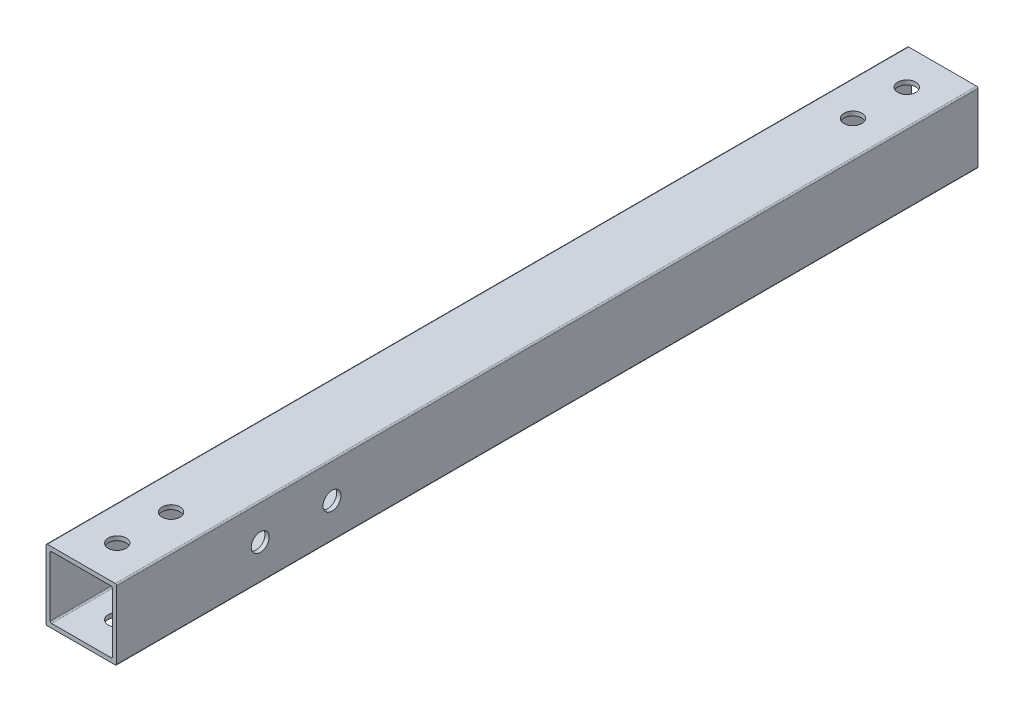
ISO-10303-21;
HEADER;
FILE_DESCRIPTION(('STEP AP214'),'2;1');
FILE_NAME('part.step','',(''),(''),'','','');
FILE_SCHEMA(('AUTOMOTIVE_DESIGN { 1 0 10303 214 1 1 1 1 }'));
ENDSEC;
DATA;
#1=APPLICATION_CONTEXT('core data for automotive mechanical design processes');
#2=APPLICATION_PROTOCOL_DEFINITION('international standard','automotive_design',2000,#1);
#3=PRODUCT_CONTEXT('',#1,'mechanical');
#4=PRODUCT('Part','Part','',(#3));
#5=PRODUCT_RELATED_PRODUCT_CATEGORY('part','',(#4));
#6=PRODUCT_DEFINITION_FORMATION('','',#4);
#7=PRODUCT_DEFINITION_CONTEXT('part definition',#1,'design');
#8=PRODUCT_DEFINITION('design','',#6,#7);
#9=PRODUCT_DEFINITION_SHAPE('','',#8);
#10=(LENGTH_UNIT() NAMED_UNIT(*) SI_UNIT(.MILLI.,.METRE.));
#11=(NAMED_UNIT(*) PLANE_ANGLE_UNIT() SI_UNIT($,.RADIAN.));
#12=(NAMED_UNIT(*) SI_UNIT($,.STERADIAN.) SOLID_ANGLE_UNIT());
#13=UNCERTAINTY_MEASURE_WITH_UNIT(LENGTH_MEASURE(1.E-05),#10,'distance_accuracy_value','');
#14=(GEOMETRIC_REPRESENTATION_CONTEXT(3) GLOBAL_UNCERTAINTY_ASSIGNED_CONTEXT((#13)) GLOBAL_UNIT_ASSIGNED_CONTEXT((#10,
#11,#12)) REPRESENTATION_CONTEXT('',''));
#15=CARTESIAN_POINT('',(0.,0.,0.));
#16=DIRECTION('',(0.,0.,1.));
#17=DIRECTION('',(1.,0.,0.));
#18=AXIS2_PLACEMENT_3D('',#15,#16,#17);
#19=CARTESIAN_POINT('',(-11.9999999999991,-11.9999999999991,-1695.2));
#20=DIRECTION('',(0.,0.,-1.));
#21=DIRECTION('',(-1.,0.,0.));
#22=AXIS2_PLACEMENT_3D('',#19,#20,#21);
#23=CYLINDRICAL_SURFACE('',#22,0.500000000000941);
#24=CARTESIAN_POINT('',(-11.9999999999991,-11.9999999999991,-2000.));
#25=DIRECTION('',(0.,0.,-1.));
#26=DIRECTION('',(-1.,0.,0.));
#27=AXIS2_PLACEMENT_3D('',#24,#25,#26);
#28=CIRCLE('',#27,0.500000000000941);
#29=CARTESIAN_POINT('',(-11.9999999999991,-12.5,-2000.));
#30=VERTEX_POINT('',#29);
#31=CARTESIAN_POINT('',(-12.5,-11.9999999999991,-2000.));
#32=VERTEX_POINT('',#31);
#33=EDGE_CURVE('E219',#30,#32,#28,.T.);
#34=ORIENTED_EDGE('',*,*,#33,.F.);
#35=DIRECTION('',(0.,0.,-1.));
#36=VECTOR('',#35,1.);
#37=CARTESIAN_POINT('',(-11.9999999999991,-12.5,-1695.2));
#38=LINE('',#37,#36);
#39=CARTESIAN_POINT('',(-11.9999999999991,-12.5,-1695.2));
#40=VERTEX_POINT('',#39);
#41=EDGE_CURVE('E11',#40,#30,#38,.T.);
#42=ORIENTED_EDGE('',*,*,#41,.F.);
#43=CARTESIAN_POINT('',(-11.9999999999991,-11.9999999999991,-1695.2));
#44=DIRECTION('',(0.,0.,-1.));
#45=DIRECTION('',(-1.,0.,0.));
#46=AXIS2_PLACEMENT_3D('',#43,#44,#45);
#47=CIRCLE('',#46,0.500000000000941);
#48=CARTESIAN_POINT('',(-12.5,-11.9999999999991,-1695.2));
#49=VERTEX_POINT('',#48);
#50=EDGE_CURVE('E231',#40,#49,#47,.T.);
#51=ORIENTED_EDGE('',*,*,#50,.T.);
#52=DIRECTION('',(0.,0.,-1.));
#53=VECTOR('',#52,1.);
#54=CARTESIAN_POINT('',(-12.5,-11.9999999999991,-1695.2));
#55=LINE('',#54,#53);
#56=EDGE_CURVE('E256',#49,#32,#55,.T.);
#57=ORIENTED_EDGE('',*,*,#56,.T.);
#58=EDGE_LOOP('',(#34,#42,#51,#57));
#59=FACE_BOUND('',#58,.T.);
#60=ADVANCED_FACE('F46',(#59),#23,.T.);
#61=CARTESIAN_POINT('',(11.9999999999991,-12.5,-1695.2));
#62=DIRECTION('',(0.,-1.,0.));
#63=DIRECTION('',(1.,0.,0.));
#64=AXIS2_PLACEMENT_3D('',#61,#62,#63);
#65=PLANE('',#64);
#66=CARTESIAN_POINT('',(0.,-12.5,-1987.3));
#67=DIRECTION('',(0.,-1.,0.));
#68=DIRECTION('',(1.,0.,0.));
#69=AXIS2_PLACEMENT_3D('',#66,#67,#68);
#70=CIRCLE('',#69,3.17500000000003);
#71=CARTESIAN_POINT('',(3.17500000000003,-12.5,-1987.3));
#72=VERTEX_POINT('',#71);
#73=EDGE_CURVE('E295',#72,#72,#70,.F.);
#74=ORIENTED_EDGE('',*,*,#73,.T.);
#75=EDGE_LOOP('',(#74));
#76=FACE_BOUND('',#75,.T.);
#77=CARTESIAN_POINT('',(0.,-12.5,-1726.95));
#78=DIRECTION('',(0.,-1.,0.));
#79=DIRECTION('',(1.,0.,0.));
#80=AXIS2_PLACEMENT_3D('',#77,#78,#79);
#81=CIRCLE('',#80,3.17500000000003);
#82=CARTESIAN_POINT('',(3.17500000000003,-12.5,-1726.95));
#83=VERTEX_POINT('',#82);
#84=EDGE_CURVE('E331',#83,#83,#81,.F.);
#85=ORIENTED_EDGE('',*,*,#84,.T.);
#86=EDGE_LOOP('',(#85));
#87=FACE_BOUND('',#86,.T.);
#88=CARTESIAN_POINT('',(0.,-12.5,-1707.9));
#89=DIRECTION('',(0.,-1.,0.));
#90=DIRECTION('',(1.,0.,0.));
#91=AXIS2_PLACEMENT_3D('',#88,#89,#90);
#92=CIRCLE('',#91,3.17500000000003);
#93=CARTESIAN_POINT('',(3.17500000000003,-12.5,-1707.9));
#94=VERTEX_POINT('',#93);
#95=EDGE_CURVE('E343',#94,#94,#92,.F.);
#96=ORIENTED_EDGE('',*,*,#95,.T.);
#97=EDGE_LOOP('',(#96));
#98=FACE_BOUND('',#97,.T.);
#99=CARTESIAN_POINT('',(0.,-12.5,-1968.25));
#100=DIRECTION('',(0.,-1.,0.));
#101=DIRECTION('',(1.,0.,0.));
#102=AXIS2_PLACEMENT_3D('',#99,#100,#101);
#103=CIRCLE('',#102,3.17500000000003);
#104=CARTESIAN_POINT('',(3.17500000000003,-12.5,-1968.25));
#105=VERTEX_POINT('',#104);
#106=EDGE_CURVE('E344',#105,#105,#103,.F.);
#107=ORIENTED_EDGE('',*,*,#106,.T.);
#108=EDGE_LOOP('',(#107));
#109=FACE_BOUND('',#108,.T.);
#110=DIRECTION('',(-1.,0.,0.));
#111=VECTOR('',#110,1.);
#112=CARTESIAN_POINT('',(11.9999999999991,-12.5,-2000.));
#113=LINE('',#112,#111);
#114=CARTESIAN_POINT('',(11.9999999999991,-12.5,-2000.));
#115=VERTEX_POINT('',#114);
#116=EDGE_CURVE('E235',#115,#30,#113,.T.);
#117=ORIENTED_EDGE('',*,*,#116,.F.);
#118=DIRECTION('',(0.,0.,-1.));
#119=VECTOR('',#118,1.);
#120=CARTESIAN_POINT('',(11.9999999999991,-12.5,-1695.2));
#121=LINE('',#120,#119);
#122=CARTESIAN_POINT('',(11.9999999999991,-12.5,-1695.2));
#123=VERTEX_POINT('',#122);
#124=EDGE_CURVE('E54',#123,#115,#121,.T.);
#125=ORIENTED_EDGE('',*,*,#124,.F.);
#126=DIRECTION('',(-1.,0.,0.));
#127=VECTOR('',#126,1.);
#128=CARTESIAN_POINT('',(11.9999999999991,-12.5,-1695.2));
#129=LINE('',#128,#127);
#130=EDGE_CURVE('E253',#123,#40,#129,.T.);
#131=ORIENTED_EDGE('',*,*,#130,.T.);
#132=ORIENTED_EDGE('',*,*,#41,.T.);
#133=EDGE_LOOP('',(#117,#125,#131,#132));
#134=FACE_BOUND('',#133,.T.);
#135=ADVANCED_FACE('F387',(#76,#87,#98,#109,#134),#65,.T.);
#136=CARTESIAN_POINT('',(11.9999999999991,-11.9999999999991,-1695.2));
#137=DIRECTION('',(0.,0.,-1.));
#138=DIRECTION('',(-1.,0.,0.));
#139=AXIS2_PLACEMENT_3D('',#136,#137,#138);
#140=CYLINDRICAL_SURFACE('',#139,0.500000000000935);
#141=CARTESIAN_POINT('',(11.9999999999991,-11.9999999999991,-2000.));
#142=DIRECTION('',(0.,0.,-1.));
#143=DIRECTION('',(-1.,0.,0.));
#144=AXIS2_PLACEMENT_3D('',#141,#142,#143);
#145=CIRCLE('',#144,0.500000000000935);
#146=CARTESIAN_POINT('',(12.5,-11.9999999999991,-2000.));
#147=VERTEX_POINT('',#146);
#148=EDGE_CURVE('E274',#147,#115,#145,.T.);
#149=ORIENTED_EDGE('',*,*,#148,.F.);
#150=DIRECTION('',(0.,0.,-1.));
#151=VECTOR('',#150,1.);
#152=CARTESIAN_POINT('',(12.5,-11.9999999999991,-1695.2));
#153=LINE('',#152,#151);
#154=CARTESIAN_POINT('',(12.5,-11.9999999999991,-1695.2));
#155=VERTEX_POINT('',#154);
#156=EDGE_CURVE('E280',#155,#147,#153,.T.);
#157=ORIENTED_EDGE('',*,*,#156,.F.);
#158=CARTESIAN_POINT('',(11.9999999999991,-11.9999999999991,-1695.2));
#159=DIRECTION('',(0.,0.,-1.));
#160=DIRECTION('',(-1.,0.,0.));
#161=AXIS2_PLACEMENT_3D('',#158,#159,#160);
#162=CIRCLE('',#161,0.500000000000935);
#163=EDGE_CURVE('E250',#155,#123,#162,.T.);
#164=ORIENTED_EDGE('',*,*,#163,.T.);
#165=ORIENTED_EDGE('',*,*,#124,.T.);
#166=EDGE_LOOP('',(#149,#157,#164,#165));
#167=FACE_BOUND('',#166,.T.);
#168=ADVANCED_FACE('F392',(#167),#140,.T.);
#169=CARTESIAN_POINT('',(12.5,11.9999999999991,-1695.2));
#170=DIRECTION('',(1.,0.,0.));
#171=DIRECTION('',(0.,1.,0.));
#172=AXIS2_PLACEMENT_3D('',#169,#170,#171);
#173=PLANE('',#172);
#174=CARTESIAN_POINT('',(12.5,0.,-1771.4));
#175=DIRECTION('',(1.,0.,0.));
#176=DIRECTION('',(0.,1.,0.));
#177=AXIS2_PLACEMENT_3D('',#174,#175,#176);
#178=CIRCLE('',#177,3.17499999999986);
#179=CARTESIAN_POINT('',(12.5,3.17499999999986,-1771.4));
#180=VERTEX_POINT('',#179);
#181=EDGE_CURVE('E315',#180,#180,#178,.T.);
#182=ORIENTED_EDGE('',*,*,#181,.F.);
#183=EDGE_LOOP('',(#182));
#184=FACE_BOUND('',#183,.T.);
#185=CARTESIAN_POINT('',(12.5,0.,-1746.));
#186=DIRECTION('',(1.,0.,0.));
#187=DIRECTION('',(0.,1.,0.));
#188=AXIS2_PLACEMENT_3D('',#185,#186,#187);
#189=CIRCLE('',#188,3.17499999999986);
#190=CARTESIAN_POINT('',(12.5,3.17499999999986,-1746.));
#191=VERTEX_POINT('',#190);
#192=EDGE_CURVE('E320',#191,#191,#189,.T.);
#193=ORIENTED_EDGE('',*,*,#192,.F.);
#194=EDGE_LOOP('',(#193));
#195=FACE_BOUND('',#194,.T.);
#196=DIRECTION('',(0.,-1.,0.));
#197=VECTOR('',#196,1.);
#198=CARTESIAN_POINT('',(12.5,11.9999999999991,-2000.));
#199=LINE('',#198,#197);
#200=CARTESIAN_POINT('',(12.5,11.9999999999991,-2000.));
#201=VERTEX_POINT('',#200);
#202=EDGE_CURVE('E271',#201,#147,#199,.T.);
#203=ORIENTED_EDGE('',*,*,#202,.F.);
#204=DIRECTION('',(0.,0.,-1.));
#205=VECTOR('',#204,1.);
#206=CARTESIAN_POINT('',(12.5,11.9999999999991,-1695.2));
#207=LINE('',#206,#205);
#208=CARTESIAN_POINT('',(12.5,11.9999999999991,-1695.2));
#209=VERTEX_POINT('',#208);
#210=EDGE_CURVE('E282',#209,#201,#207,.T.);
#211=ORIENTED_EDGE('',*,*,#210,.F.);
#212=DIRECTION('',(0.,-1.,0.));
#213=VECTOR('',#212,1.);
#214=CARTESIAN_POINT('',(12.5,11.9999999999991,-1695.2));
#215=LINE('',#214,#213);
#216=EDGE_CURVE('E247',#209,#155,#215,.T.);
#217=ORIENTED_EDGE('',*,*,#216,.T.);
#218=ORIENTED_EDGE('',*,*,#156,.T.);
#219=EDGE_LOOP('',(#203,#211,#217,#218));
#220=FACE_BOUND('',#219,.T.);
#221=ADVANCED_FACE('F423',(#184,#195,#220),#173,.T.);
#222=CARTESIAN_POINT('',(11.9999999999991,11.9999999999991,-1695.2));
#223=DIRECTION('',(0.,0.,-1.));
#224=DIRECTION('',(-1.,0.,0.));
#225=AXIS2_PLACEMENT_3D('',#222,#223,#224);
#226=CYLINDRICAL_SURFACE('',#225,0.500000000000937);
#227=CARTESIAN_POINT('',(11.9999999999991,11.9999999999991,-2000.));
#228=DIRECTION('',(0.,0.,-1.));
#229=DIRECTION('',(-1.,0.,0.));
#230=AXIS2_PLACEMENT_3D('',#227,#228,#229);
#231=CIRCLE('',#230,0.500000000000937);
#232=CARTESIAN_POINT('',(11.9999999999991,12.5,-2000.));
#233=VERTEX_POINT('',#232);
#234=EDGE_CURVE('E268',#233,#201,#231,.T.);
#235=ORIENTED_EDGE('',*,*,#234,.F.);
#236=DIRECTION('',(0.,0.,-1.));
#237=VECTOR('',#236,1.);
#238=CARTESIAN_POINT('',(11.9999999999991,12.5,-1695.2));
#239=LINE('',#238,#237);
#240=CARTESIAN_POINT('',(11.9999999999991,12.5,-1695.2));
#241=VERTEX_POINT('',#240);
#242=EDGE_CURVE('E284',#241,#233,#239,.T.);
#243=ORIENTED_EDGE('',*,*,#242,.F.);
#244=CARTESIAN_POINT('',(11.9999999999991,11.9999999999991,-1695.2));
#245=DIRECTION('',(0.,0.,-1.));
#246=DIRECTION('',(-1.,0.,0.));
#247=AXIS2_PLACEMENT_3D('',#244,#245,#246);
#248=CIRCLE('',#247,0.500000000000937);
#249=EDGE_CURVE('E244',#241,#209,#248,.T.);
#250=ORIENTED_EDGE('',*,*,#249,.T.);
#251=ORIENTED_EDGE('',*,*,#210,.T.);
#252=EDGE_LOOP('',(#235,#243,#250,#251));
#253=FACE_BOUND('',#252,.T.);
#254=ADVANCED_FACE('F420',(#253),#226,.T.);
#255=CARTESIAN_POINT('',(-11.9999999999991,12.5,-1695.2));
#256=DIRECTION('',(0.,1.,0.));
#257=DIRECTION('',(-1.,0.,0.));
#258=AXIS2_PLACEMENT_3D('',#255,#256,#257);
#259=PLANE('',#258);
#260=CARTESIAN_POINT('',(0.,12.5,-1987.3));
#261=DIRECTION('',(0.,1.,0.));
#262=DIRECTION('',(-1.,0.,0.));
#263=AXIS2_PLACEMENT_3D('',#260,#261,#262);
#264=CIRCLE('',#263,3.17500000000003);
#265=CARTESIAN_POINT('',(-3.17500000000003,12.5,-1987.3));
#266=VERTEX_POINT('',#265);
#267=EDGE_CURVE('E332',#266,#266,#264,.T.);
#268=ORIENTED_EDGE('',*,*,#267,.F.);
#269=EDGE_LOOP('',(#268));
#270=FACE_BOUND('',#269,.T.);
#271=CARTESIAN_POINT('',(0.,12.5,-1726.95));
#272=DIRECTION('',(0.,1.,0.));
#273=DIRECTION('',(1.,0.,0.));
#274=AXIS2_PLACEMENT_3D('',#271,#272,#273);
#275=CIRCLE('',#274,3.17500000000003);
#276=CARTESIAN_POINT('',(3.17500000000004,12.5,-1726.95));
#277=VERTEX_POINT('',#276);
#278=EDGE_CURVE('E340',#277,#277,#275,.T.);
#279=ORIENTED_EDGE('',*,*,#278,.F.);
#280=EDGE_LOOP('',(#279));
#281=FACE_BOUND('',#280,.T.);
#282=CARTESIAN_POINT('',(0.,12.5,-1707.9));
#283=DIRECTION('',(0.,1.,0.));
#284=DIRECTION('',(1.,0.,0.));
#285=AXIS2_PLACEMENT_3D('',#282,#283,#284);
#286=CIRCLE('',#285,3.17500000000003);
#287=CARTESIAN_POINT('',(3.17500000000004,12.5,-1707.9));
#288=VERTEX_POINT('',#287);
#289=EDGE_CURVE('E347',#288,#288,#286,.T.);
#290=ORIENTED_EDGE('',*,*,#289,.F.);
#291=EDGE_LOOP('',(#290));
#292=FACE_BOUND('',#291,.T.);
#293=CARTESIAN_POINT('',(0.,12.5,-1968.25));
#294=DIRECTION('',(0.,1.,0.));
#295=DIRECTION('',(-1.,0.,0.));
#296=AXIS2_PLACEMENT_3D('',#293,#294,#295);
#297=CIRCLE('',#296,3.17500000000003);
#298=CARTESIAN_POINT('',(-3.17500000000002,12.5,-1968.25));
#299=VERTEX_POINT('',#298);
#300=EDGE_CURVE('E335',#299,#299,#297,.T.);
#301=ORIENTED_EDGE('',*,*,#300,.F.);
#302=EDGE_LOOP('',(#301));
#303=FACE_BOUND('',#302,.T.);
#304=DIRECTION('',(1.,0.,0.));
#305=VECTOR('',#304,1.);
#306=CARTESIAN_POINT('',(-11.9999999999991,12.5,-2000.));
#307=LINE('',#306,#305);
#308=CARTESIAN_POINT('',(-11.9999999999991,12.5,-2000.));
#309=VERTEX_POINT('',#308);
#310=EDGE_CURVE('E265',#309,#233,#307,.T.);
#311=ORIENTED_EDGE('',*,*,#310,.F.);
#312=DIRECTION('',(0.,0.,-1.));
#313=VECTOR('',#312,1.);
#314=CARTESIAN_POINT('',(-11.9999999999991,12.5,-1695.2));
#315=LINE('',#314,#313);
#316=CARTESIAN_POINT('',(-11.9999999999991,12.5,-1695.2));
#317=VERTEX_POINT('',#316);
#318=EDGE_CURVE('E286',#317,#309,#315,.T.);
#319=ORIENTED_EDGE('',*,*,#318,.F.);
#320=DIRECTION('',(1.,0.,0.));
#321=VECTOR('',#320,1.);
#322=CARTESIAN_POINT('',(-11.9999999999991,12.5,-1695.2));
#323=LINE('',#322,#321);
#324=EDGE_CURVE('E241',#317,#241,#323,.T.);
#325=ORIENTED_EDGE('',*,*,#324,.T.);
#326=ORIENTED_EDGE('',*,*,#242,.T.);
#327=EDGE_LOOP('',(#311,#319,#325,#326));
#328=FACE_BOUND('',#327,.T.);
#329=ADVANCED_FACE('F416',(#270,#281,#292,#303,#328),#259,.T.);
#330=CARTESIAN_POINT('',(-11.9999999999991,11.9999999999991,-1695.2));
#331=DIRECTION('',(0.,0.,-1.));
#332=DIRECTION('',(-1.,0.,0.));
#333=AXIS2_PLACEMENT_3D('',#330,#331,#332);
#334=CYLINDRICAL_SURFACE('',#333,0.500000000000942);
#335=CARTESIAN_POINT('',(-11.9999999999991,11.9999999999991,-2000.));
#336=DIRECTION('',(0.,0.,-1.));
#337=DIRECTION('',(-1.,0.,0.));
#338=AXIS2_PLACEMENT_3D('',#335,#336,#337);
#339=CIRCLE('',#338,0.500000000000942);
#340=CARTESIAN_POINT('',(-12.5,11.9999999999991,-2000.));
#341=VERTEX_POINT('',#340);
#342=EDGE_CURVE('E262',#341,#309,#339,.T.);
#343=ORIENTED_EDGE('',*,*,#342,.F.);
#344=DIRECTION('',(0.,0.,-1.));
#345=VECTOR('',#344,1.);
#346=CARTESIAN_POINT('',(-12.5,11.9999999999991,-1695.2));
#347=LINE('',#346,#345);
#348=CARTESIAN_POINT('',(-12.5,11.9999999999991,-1695.2));
#349=VERTEX_POINT('',#348);
#350=EDGE_CURVE('E288',#349,#341,#347,.T.);
#351=ORIENTED_EDGE('',*,*,#350,.F.);
#352=CARTESIAN_POINT('',(-11.9999999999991,11.9999999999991,-1695.2));
#353=DIRECTION('',(0.,0.,-1.));
#354=DIRECTION('',(-1.,0.,0.));
#355=AXIS2_PLACEMENT_3D('',#352,#353,#354);
#356=CIRCLE('',#355,0.500000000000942);
#357=EDGE_CURVE('E238',#349,#317,#356,.T.);
#358=ORIENTED_EDGE('',*,*,#357,.T.);
#359=ORIENTED_EDGE('',*,*,#318,.T.);
#360=EDGE_LOOP('',(#343,#351,#358,#359));
#361=FACE_BOUND('',#360,.T.);
#362=ADVANCED_FACE('F414',(#361),#334,.T.);
#363=CARTESIAN_POINT('',(-12.5,-11.9999999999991,-1695.2));
#364=DIRECTION('',(-1.,0.,0.));
#365=DIRECTION('',(0.,0.,1.));
#366=AXIS2_PLACEMENT_3D('',#363,#364,#365);
#367=PLANE('',#366);
#368=CARTESIAN_POINT('',(-12.5,0.,-1771.4));
#369=DIRECTION('',(-1.,0.,0.));
#370=DIRECTION('',(0.,0.,1.));
#371=AXIS2_PLACEMENT_3D('',#368,#369,#370);
#372=CIRCLE('',#371,3.17499999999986);
#373=CARTESIAN_POINT('',(-12.5,3.17499999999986,-1771.4));
#374=VERTEX_POINT('',#373);
#375=EDGE_CURVE('E309',#374,#374,#372,.F.);
#376=ORIENTED_EDGE('',*,*,#375,.T.);
#377=EDGE_LOOP('',(#376));
#378=FACE_BOUND('',#377,.T.);
#379=CARTESIAN_POINT('',(-12.5,0.,-1746.));
#380=DIRECTION('',(-1.,0.,0.));
#381=DIRECTION('',(0.,0.,1.));
#382=AXIS2_PLACEMENT_3D('',#379,#380,#381);
#383=CIRCLE('',#382,3.17499999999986);
#384=CARTESIAN_POINT('',(-12.5,3.17499999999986,-1746.));
#385=VERTEX_POINT('',#384);
#386=EDGE_CURVE('E323',#385,#385,#383,.F.);
#387=ORIENTED_EDGE('',*,*,#386,.T.);
#388=EDGE_LOOP('',(#387));
#389=FACE_BOUND('',#388,.T.);
#390=DIRECTION('',(0.,1.,0.));
#391=VECTOR('',#390,1.);
#392=CARTESIAN_POINT('',(-12.5,-11.9999999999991,-2000.));
#393=LINE('',#392,#391);
#394=EDGE_CURVE('E259',#32,#341,#393,.T.);
#395=ORIENTED_EDGE('',*,*,#394,.F.);
#396=ORIENTED_EDGE('',*,*,#56,.F.);
#397=DIRECTION('',(0.,1.,0.));
#398=VECTOR('',#397,1.);
#399=CARTESIAN_POINT('',(-12.5,-11.9999999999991,-1695.2));
#400=LINE('',#399,#398);
#401=EDGE_CURVE('E234',#49,#349,#400,.T.);
#402=ORIENTED_EDGE('',*,*,#401,.T.);
#403=ORIENTED_EDGE('',*,*,#350,.T.);
#404=EDGE_LOOP('',(#395,#396,#402,#403));
#405=FACE_BOUND('',#404,.T.);
#406=ADVANCED_FACE('F410',(#378,#389,#405),#367,.T.);
#407=CARTESIAN_POINT('',(-11.9999999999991,-11.9999999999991,-1695.2));
#408=DIRECTION('',(0.,0.,-1.));
#409=DIRECTION('',(-1.,0.,0.));
#410=AXIS2_PLACEMENT_3D('',#407,#408,#409);
#411=PLANE('',#410);
#412=DIRECTION('',(0.,1.,0.));
#413=VECTOR('',#412,1.);
#414=CARTESIAN_POINT('',(-11.,10.4999999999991,-1695.2));
#415=LINE('',#414,#413);
#416=CARTESIAN_POINT('',(-11.,-10.4999999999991,-1695.2));
#417=VERTEX_POINT('',#416);
#418=CARTESIAN_POINT('',(-11.,10.4999999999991,-1695.2));
#419=VERTEX_POINT('',#418);
#420=EDGE_CURVE('E167',#417,#419,#415,.T.);
#421=ORIENTED_EDGE('',*,*,#420,.T.);
#422=CARTESIAN_POINT('',(-10.4999999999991,10.4999999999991,-1695.2));
#423=DIRECTION('',(0.,0.,-1.));
#424=DIRECTION('',(1.,0.,0.));
#425=AXIS2_PLACEMENT_3D('',#422,#423,#424);
#426=CIRCLE('',#425,0.500000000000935);
#427=CARTESIAN_POINT('',(-10.4999999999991,11.,-1695.2));
#428=VERTEX_POINT('',#427);
#429=EDGE_CURVE('E161',#419,#428,#426,.T.);
#430=ORIENTED_EDGE('',*,*,#429,.T.);
#431=DIRECTION('',(1.,0.,0.));
#432=VECTOR('',#431,1.);
#433=CARTESIAN_POINT('',(10.4999999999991,11.,-1695.2));
#434=LINE('',#433,#432);
#435=CARTESIAN_POINT('',(10.4999999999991,11.,-1695.2));
#436=VERTEX_POINT('',#435);
#437=EDGE_CURVE('E170',#428,#436,#434,.T.);
#438=ORIENTED_EDGE('',*,*,#437,.T.);
#439=CARTESIAN_POINT('',(10.4999999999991,10.4999999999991,-1695.2));
#440=DIRECTION('',(0.,0.,-1.));
#441=DIRECTION('',(1.,0.,0.));
#442=AXIS2_PLACEMENT_3D('',#439,#440,#441);
#443=CIRCLE('',#442,0.500000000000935);
#444=CARTESIAN_POINT('',(11.,10.4999999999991,-1695.2));
#445=VERTEX_POINT('',#444);
#446=EDGE_CURVE('E62',#436,#445,#443,.T.);
#447=ORIENTED_EDGE('',*,*,#446,.T.);
#448=DIRECTION('',(0.,-1.,0.));
#449=VECTOR('',#448,1.);
#450=CARTESIAN_POINT('',(11.,-10.4999999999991,-1695.2));
#451=LINE('',#450,#449);
#452=CARTESIAN_POINT('',(11.,-10.4999999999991,-1695.2));
#453=VERTEX_POINT('',#452);
#454=EDGE_CURVE('E188',#445,#453,#451,.T.);
#455=ORIENTED_EDGE('',*,*,#454,.T.);
#456=CARTESIAN_POINT('',(10.4999999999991,-10.4999999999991,-1695.2));
#457=DIRECTION('',(0.,0.,-1.));
#458=DIRECTION('',(1.,0.,0.));
#459=AXIS2_PLACEMENT_3D('',#456,#457,#458);
#460=CIRCLE('',#459,0.500000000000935);
#461=CARTESIAN_POINT('',(10.4999999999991,-11.,-1695.2));
#462=VERTEX_POINT('',#461);
#463=EDGE_CURVE('E191',#453,#462,#460,.T.);
#464=ORIENTED_EDGE('',*,*,#463,.T.);
#465=DIRECTION('',(-1.,0.,0.));
#466=VECTOR('',#465,1.);
#467=CARTESIAN_POINT('',(-10.4999999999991,-11.,-1695.2));
#468=LINE('',#467,#466);
#469=CARTESIAN_POINT('',(-10.4999999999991,-11.,-1695.2));
#470=VERTEX_POINT('',#469);
#471=EDGE_CURVE('E194',#462,#470,#468,.T.);
#472=ORIENTED_EDGE('',*,*,#471,.T.);
#473=CARTESIAN_POINT('',(-10.4999999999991,-10.4999999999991,-1695.2));
#474=DIRECTION('',(0.,0.,-1.));
#475=DIRECTION('',(1.,0.,0.));
#476=AXIS2_PLACEMENT_3D('',#473,#474,#475);
#477=CIRCLE('',#476,0.500000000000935);
#478=EDGE_CURVE('E197',#470,#417,#477,.T.);
#479=ORIENTED_EDGE('',*,*,#478,.T.);
#480=EDGE_LOOP('',(#421,#430,#438,#447,#455,#464,#472,#479));
#481=FACE_BOUND('',#480,.T.);
#482=ORIENTED_EDGE('',*,*,#50,.F.);
#483=ORIENTED_EDGE('',*,*,#130,.F.);
#484=ORIENTED_EDGE('',*,*,#163,.F.);
#485=ORIENTED_EDGE('',*,*,#216,.F.);
#486=ORIENTED_EDGE('',*,*,#249,.F.);
#487=ORIENTED_EDGE('',*,*,#324,.F.);
#488=ORIENTED_EDGE('',*,*,#357,.F.);
#489=ORIENTED_EDGE('',*,*,#401,.F.);
#490=EDGE_LOOP('',(#482,#483,#484,#485,#486,#487,#488,#489));
#491=FACE_BOUND('',#490,.T.);
#492=ADVANCED_FACE('F174',(#481,#491),#411,.F.);
#493=CARTESIAN_POINT('',(-11.9999999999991,-11.9999999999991,-2000.));
#494=DIRECTION('',(0.,0.,-1.));
#495=DIRECTION('',(-1.,0.,0.));
#496=AXIS2_PLACEMENT_3D('',#493,#494,#495);
#497=PLANE('',#496);
#498=CARTESIAN_POINT('',(-10.4999999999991,10.4999999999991,-2000.));
#499=DIRECTION('',(0.,0.,-1.));
#500=DIRECTION('',(1.,0.,0.));
#501=AXIS2_PLACEMENT_3D('',#498,#499,#500);
#502=CIRCLE('',#501,0.500000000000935);
#503=CARTESIAN_POINT('',(-11.,10.4999999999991,-2000.));
#504=VERTEX_POINT('',#503);
#505=CARTESIAN_POINT('',(-10.4999999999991,11.,-2000.));
#506=VERTEX_POINT('',#505);
#507=EDGE_CURVE('E70',#504,#506,#502,.T.);
#508=ORIENTED_EDGE('',*,*,#507,.F.);
#509=DIRECTION('',(0.,1.,0.));
#510=VECTOR('',#509,1.);
#511=CARTESIAN_POINT('',(-11.,10.4999999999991,-2000.));
#512=LINE('',#511,#510);
#513=CARTESIAN_POINT('',(-11.,-10.4999999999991,-2000.));
#514=VERTEX_POINT('',#513);
#515=EDGE_CURVE('E178',#514,#504,#512,.T.);
#516=ORIENTED_EDGE('',*,*,#515,.F.);
#517=CARTESIAN_POINT('',(-10.4999999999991,-10.4999999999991,-2000.));
#518=DIRECTION('',(0.,0.,-1.));
#519=DIRECTION('',(1.,0.,0.));
#520=AXIS2_PLACEMENT_3D('',#517,#518,#519);
#521=CIRCLE('',#520,0.500000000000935);
#522=CARTESIAN_POINT('',(-10.4999999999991,-11.,-2000.));
#523=VERTEX_POINT('',#522);
#524=EDGE_CURVE('E181',#523,#514,#521,.T.);
#525=ORIENTED_EDGE('',*,*,#524,.F.);
#526=DIRECTION('',(-1.,0.,0.));
#527=VECTOR('',#526,1.);
#528=CARTESIAN_POINT('',(-10.4999999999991,-11.,-2000.));
#529=LINE('',#528,#527);
#530=CARTESIAN_POINT('',(10.4999999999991,-11.,-2000.));
#531=VERTEX_POINT('',#530);
#532=EDGE_CURVE('E212',#531,#523,#529,.T.);
#533=ORIENTED_EDGE('',*,*,#532,.F.);
#534=CARTESIAN_POINT('',(10.4999999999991,-10.4999999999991,-2000.));
#535=DIRECTION('',(0.,0.,-1.));
#536=DIRECTION('',(1.,0.,0.));
#537=AXIS2_PLACEMENT_3D('',#534,#535,#536);
#538=CIRCLE('',#537,0.500000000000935);
#539=CARTESIAN_POINT('',(11.,-10.4999999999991,-2000.));
#540=VERTEX_POINT('',#539);
#541=EDGE_CURVE('E209',#540,#531,#538,.T.);
#542=ORIENTED_EDGE('',*,*,#541,.F.);
#543=DIRECTION('',(0.,-1.,0.));
#544=VECTOR('',#543,1.);
#545=CARTESIAN_POINT('',(11.,-10.4999999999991,-2000.));
#546=LINE('',#545,#544);
#547=CARTESIAN_POINT('',(11.,10.4999999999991,-2000.));
#548=VERTEX_POINT('',#547);
#549=EDGE_CURVE('E206',#548,#540,#546,.T.);
#550=ORIENTED_EDGE('',*,*,#549,.F.);
#551=CARTESIAN_POINT('',(10.4999999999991,10.4999999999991,-2000.));
#552=DIRECTION('',(0.,0.,-1.));
#553=DIRECTION('',(1.,0.,0.));
#554=AXIS2_PLACEMENT_3D('',#551,#552,#553);
#555=CIRCLE('',#554,0.500000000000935);
#556=CARTESIAN_POINT('',(10.4999999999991,11.,-2000.));
#557=VERTEX_POINT('',#556);
#558=EDGE_CURVE('E203',#557,#548,#555,.T.);
#559=ORIENTED_EDGE('',*,*,#558,.F.);
#560=DIRECTION('',(1.,0.,0.));
#561=VECTOR('',#560,1.);
#562=CARTESIAN_POINT('',(10.4999999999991,11.,-2000.));
#563=LINE('',#562,#561);
#564=EDGE_CURVE('E201',#506,#557,#563,.T.);
#565=ORIENTED_EDGE('',*,*,#564,.F.);
#566=EDGE_LOOP('',(#508,#516,#525,#533,#542,#550,#559,#565));
#567=FACE_BOUND('',#566,.T.);
#568=ORIENTED_EDGE('',*,*,#33,.T.);
#569=ORIENTED_EDGE('',*,*,#394,.T.);
#570=ORIENTED_EDGE('',*,*,#342,.T.);
#571=ORIENTED_EDGE('',*,*,#310,.T.);
#572=ORIENTED_EDGE('',*,*,#234,.T.);
#573=ORIENTED_EDGE('',*,*,#202,.T.);
#574=ORIENTED_EDGE('',*,*,#148,.T.);
#575=ORIENTED_EDGE('',*,*,#116,.T.);
#576=EDGE_LOOP('',(#568,#569,#570,#571,#572,#573,#574,#575));
#577=FACE_BOUND('',#576,.T.);
#578=ADVANCED_FACE('F400',(#567,#577),#497,.T.);
#579=CARTESIAN_POINT('',(-10.4999999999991,10.4999999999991,-1695.2));
#580=DIRECTION('',(0.,0.,-1.));
#581=DIRECTION('',(-1.,0.,0.));
#582=AXIS2_PLACEMENT_3D('',#579,#580,#581);
#583=CYLINDRICAL_SURFACE('',#582,0.500000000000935);
#584=ORIENTED_EDGE('',*,*,#507,.T.);
#585=DIRECTION('',(0.,0.,-1.));
#586=VECTOR('',#585,1.);
#587=CARTESIAN_POINT('',(-10.4999999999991,11.,-1695.2));
#588=LINE('',#587,#586);
#589=EDGE_CURVE('E157',#428,#506,#588,.T.);
#590=ORIENTED_EDGE('',*,*,#589,.F.);
#591=ORIENTED_EDGE('',*,*,#429,.F.);
#592=DIRECTION('',(0.,0.,-1.));
#593=VECTOR('',#592,1.);
#594=CARTESIAN_POINT('',(-11.,10.4999999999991,-1695.2));
#595=LINE('',#594,#593);
#596=EDGE_CURVE('E217',#419,#504,#595,.T.);
#597=ORIENTED_EDGE('',*,*,#596,.T.);
#598=EDGE_LOOP('',(#584,#590,#591,#597));
#599=FACE_BOUND('',#598,.T.);
#600=ADVANCED_FACE('F159',(#599),#583,.F.);
#601=CARTESIAN_POINT('',(-11.,10.4999999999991,-1695.2));
#602=DIRECTION('',(-1.,0.,0.));
#603=DIRECTION('',(0.,-1.,0.));
#604=AXIS2_PLACEMENT_3D('',#601,#602,#603);
#605=PLANE('',#604);
#606=CARTESIAN_POINT('',(-11.,0.,-1771.4));
#607=DIRECTION('',(-1.,0.,0.));
#608=DIRECTION('',(0.,-1.,0.));
#609=AXIS2_PLACEMENT_3D('',#606,#607,#608);
#610=CIRCLE('',#609,3.17499999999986);
#611=CARTESIAN_POINT('',(-11.,3.17499999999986,-1771.4));
#612=VERTEX_POINT('',#611);
#613=EDGE_CURVE('E328',#612,#612,#610,.T.);
#614=ORIENTED_EDGE('',*,*,#613,.T.);
#615=EDGE_LOOP('',(#614));
#616=FACE_BOUND('',#615,.T.);
#617=CARTESIAN_POINT('',(-11.,0.,-1746.));
#618=DIRECTION('',(-1.,0.,0.));
#619=DIRECTION('',(0.,-1.,0.));
#620=AXIS2_PLACEMENT_3D('',#617,#618,#619);
#621=CIRCLE('',#620,3.17499999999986);
#622=CARTESIAN_POINT('',(-11.,3.17499999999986,-1746.));
#623=VERTEX_POINT('',#622);
#624=EDGE_CURVE('E308',#623,#623,#621,.T.);
#625=ORIENTED_EDGE('',*,*,#624,.T.);
#626=EDGE_LOOP('',(#625));
#627=FACE_BOUND('',#626,.T.);
#628=ORIENTED_EDGE('',*,*,#515,.T.);
#629=ORIENTED_EDGE('',*,*,#596,.F.);
#630=ORIENTED_EDGE('',*,*,#420,.F.);
#631=DIRECTION('',(0.,0.,-1.));
#632=VECTOR('',#631,1.);
#633=CARTESIAN_POINT('',(-11.,-10.4999999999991,-1695.2));
#634=LINE('',#633,#632);
#635=EDGE_CURVE('E220',#417,#514,#634,.T.);
#636=ORIENTED_EDGE('',*,*,#635,.T.);
#637=EDGE_LOOP('',(#628,#629,#630,#636));
#638=FACE_BOUND('',#637,.T.);
#639=ADVANCED_FACE('F456',(#616,#627,#638),#605,.F.);
#640=CARTESIAN_POINT('',(-10.4999999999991,-10.4999999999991,-1695.2));
#641=DIRECTION('',(0.,0.,-1.));
#642=DIRECTION('',(-1.,0.,0.));
#643=AXIS2_PLACEMENT_3D('',#640,#641,#642);
#644=CYLINDRICAL_SURFACE('',#643,0.500000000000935);
#645=ORIENTED_EDGE('',*,*,#524,.T.);
#646=ORIENTED_EDGE('',*,*,#635,.F.);
#647=ORIENTED_EDGE('',*,*,#478,.F.);
#648=DIRECTION('',(0.,0.,-1.));
#649=VECTOR('',#648,1.);
#650=CARTESIAN_POINT('',(-10.4999999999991,-11.,-1695.2));
#651=LINE('',#650,#649);
#652=EDGE_CURVE('E222',#470,#523,#651,.T.);
#653=ORIENTED_EDGE('',*,*,#652,.T.);
#654=EDGE_LOOP('',(#645,#646,#647,#653));
#655=FACE_BOUND('',#654,.T.);
#656=ADVANCED_FACE('F459',(#655),#644,.F.);
#657=CARTESIAN_POINT('',(-10.4999999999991,-11.,-1695.2));
#658=DIRECTION('',(0.,-1.,0.));
#659=DIRECTION('',(0.,0.,-1.));
#660=AXIS2_PLACEMENT_3D('',#657,#658,#659);
#661=PLANE('',#660);
#662=CARTESIAN_POINT('',(0.,-11.,-1987.3));
#663=DIRECTION('',(0.,-1.,0.));
#664=DIRECTION('',(0.,0.,-1.));
#665=AXIS2_PLACEMENT_3D('',#662,#663,#664);
#666=CIRCLE('',#665,3.17500000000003);
#667=CARTESIAN_POINT('',(0.,-11.,-1990.475));
#668=VERTEX_POINT('',#667);
#669=EDGE_CURVE('E184',#668,#668,#666,.T.);
#670=ORIENTED_EDGE('',*,*,#669,.T.);
#671=EDGE_LOOP('',(#670));
#672=FACE_BOUND('',#671,.T.);
#673=CARTESIAN_POINT('',(0.,-11.,-1726.95));
#674=DIRECTION('',(0.,-1.,0.));
#675=DIRECTION('',(0.,0.,-1.));
#676=AXIS2_PLACEMENT_3D('',#673,#674,#675);
#677=CIRCLE('',#676,3.17500000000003);
#678=CARTESIAN_POINT('',(0.,-11.,-1730.125));
#679=VERTEX_POINT('',#678);
#680=EDGE_CURVE('E303',#679,#679,#677,.T.);
#681=ORIENTED_EDGE('',*,*,#680,.T.);
#682=EDGE_LOOP('',(#681));
#683=FACE_BOUND('',#682,.T.);
#684=CARTESIAN_POINT('',(0.,-11.,-1707.9));
#685=DIRECTION('',(0.,-1.,0.));
#686=DIRECTION('',(0.,0.,-1.));
#687=AXIS2_PLACEMENT_3D('',#684,#685,#686);
#688=CIRCLE('',#687,3.17500000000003);
#689=CARTESIAN_POINT('',(0.,-11.,-1711.075));
#690=VERTEX_POINT('',#689);
#691=EDGE_CURVE('E299',#690,#690,#688,.T.);
#692=ORIENTED_EDGE('',*,*,#691,.T.);
#693=EDGE_LOOP('',(#692));
#694=FACE_BOUND('',#693,.T.);
#695=CARTESIAN_POINT('',(0.,-11.,-1968.25));
#696=DIRECTION('',(0.,-1.,0.));
#697=DIRECTION('',(0.,0.,-1.));
#698=AXIS2_PLACEMENT_3D('',#695,#696,#697);
#699=CIRCLE('',#698,3.17500000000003);
#700=CARTESIAN_POINT('',(0.,-11.,-1971.425));
#701=VERTEX_POINT('',#700);
#702=EDGE_CURVE('E294',#701,#701,#699,.T.);
#703=ORIENTED_EDGE('',*,*,#702,.T.);
#704=EDGE_LOOP('',(#703));
#705=FACE_BOUND('',#704,.T.);
#706=ORIENTED_EDGE('',*,*,#532,.T.);
#707=ORIENTED_EDGE('',*,*,#652,.F.);
#708=ORIENTED_EDGE('',*,*,#471,.F.);
#709=DIRECTION('',(0.,0.,-1.));
#710=VECTOR('',#709,1.);
#711=CARTESIAN_POINT('',(10.4999999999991,-11.,-1695.2));
#712=LINE('',#711,#710);
#713=EDGE_CURVE('E224',#462,#531,#712,.T.);
#714=ORIENTED_EDGE('',*,*,#713,.T.);
#715=EDGE_LOOP('',(#706,#707,#708,#714));
#716=FACE_BOUND('',#715,.T.);
#717=ADVANCED_FACE('F360',(#672,#683,#694,#705,#716),#661,.F.);
#718=CARTESIAN_POINT('',(10.4999999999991,-10.4999999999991,-1695.2));
#719=DIRECTION('',(0.,0.,-1.));
#720=DIRECTION('',(-1.,0.,0.));
#721=AXIS2_PLACEMENT_3D('',#718,#719,#720);
#722=CYLINDRICAL_SURFACE('',#721,0.500000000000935);
#723=ORIENTED_EDGE('',*,*,#541,.T.);
#724=ORIENTED_EDGE('',*,*,#713,.F.);
#725=ORIENTED_EDGE('',*,*,#463,.F.);
#726=DIRECTION('',(0.,0.,-1.));
#727=VECTOR('',#726,1.);
#728=CARTESIAN_POINT('',(11.,-10.4999999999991,-1695.2));
#729=LINE('',#728,#727);
#730=EDGE_CURVE('E226',#453,#540,#729,.T.);
#731=ORIENTED_EDGE('',*,*,#730,.T.);
#732=EDGE_LOOP('',(#723,#724,#725,#731));
#733=FACE_BOUND('',#732,.T.);
#734=ADVANCED_FACE('F475',(#733),#722,.F.);
#735=CARTESIAN_POINT('',(11.,-10.4999999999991,-1695.2));
#736=DIRECTION('',(1.,0.,0.));
#737=DIRECTION('',(0.,0.,-1.));
#738=AXIS2_PLACEMENT_3D('',#735,#736,#737);
#739=PLANE('',#738);
#740=CARTESIAN_POINT('',(11.,0.,-1771.4));
#741=DIRECTION('',(1.,0.,0.));
#742=DIRECTION('',(0.,0.,-1.));
#743=AXIS2_PLACEMENT_3D('',#740,#741,#742);
#744=CIRCLE('',#743,3.17499999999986);
#745=CARTESIAN_POINT('',(11.,0.,-1774.575));
#746=VERTEX_POINT('',#745);
#747=EDGE_CURVE('E49',#746,#746,#744,.T.);
#748=ORIENTED_EDGE('',*,*,#747,.T.);
#749=EDGE_LOOP('',(#748));
#750=FACE_BOUND('',#749,.T.);
#751=CARTESIAN_POINT('',(11.,0.,-1746.));
#752=DIRECTION('',(1.,0.,0.));
#753=DIRECTION('',(0.,0.,-1.));
#754=AXIS2_PLACEMENT_3D('',#751,#752,#753);
#755=CIRCLE('',#754,3.17499999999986);
#756=CARTESIAN_POINT('',(11.,0.,-1749.175));
#757=VERTEX_POINT('',#756);
#758=EDGE_CURVE('E306',#757,#757,#755,.T.);
#759=ORIENTED_EDGE('',*,*,#758,.T.);
#760=EDGE_LOOP('',(#759));
#761=FACE_BOUND('',#760,.T.);
#762=ORIENTED_EDGE('',*,*,#549,.T.);
#763=ORIENTED_EDGE('',*,*,#730,.F.);
#764=ORIENTED_EDGE('',*,*,#454,.F.);
#765=DIRECTION('',(0.,0.,-1.));
#766=VECTOR('',#765,1.);
#767=CARTESIAN_POINT('',(11.,10.4999999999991,-1695.2));
#768=LINE('',#767,#766);
#769=EDGE_CURVE('E228',#445,#548,#768,.T.);
#770=ORIENTED_EDGE('',*,*,#769,.T.);
#771=EDGE_LOOP('',(#762,#763,#764,#770));
#772=FACE_BOUND('',#771,.T.);
#773=ADVANCED_FACE('F471',(#750,#761,#772),#739,.F.);
#774=CARTESIAN_POINT('',(10.4999999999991,10.4999999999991,-1695.2));
#775=DIRECTION('',(0.,0.,-1.));
#776=DIRECTION('',(-1.,0.,0.));
#777=AXIS2_PLACEMENT_3D('',#774,#775,#776);
#778=CYLINDRICAL_SURFACE('',#777,0.500000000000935);
#779=ORIENTED_EDGE('',*,*,#558,.T.);
#780=ORIENTED_EDGE('',*,*,#769,.F.);
#781=ORIENTED_EDGE('',*,*,#446,.F.);
#782=DIRECTION('',(0.,0.,-1.));
#783=VECTOR('',#782,1.);
#784=CARTESIAN_POINT('',(10.4999999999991,11.,-1695.2));
#785=LINE('',#784,#783);
#786=EDGE_CURVE('E166',#436,#557,#785,.T.);
#787=ORIENTED_EDGE('',*,*,#786,.T.);
#788=EDGE_LOOP('',(#779,#780,#781,#787));
#789=FACE_BOUND('',#788,.T.);
#790=ADVANCED_FACE('F468',(#789),#778,.F.);
#791=CARTESIAN_POINT('',(10.4999999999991,11.,-1695.2));
#792=DIRECTION('',(0.,1.,0.));
#793=DIRECTION('',(-1.,0.,0.));
#794=AXIS2_PLACEMENT_3D('',#791,#792,#793);
#795=PLANE('',#794);
#796=CARTESIAN_POINT('',(0.,11.,-1987.3));
#797=DIRECTION('',(0.,1.,0.));
#798=DIRECTION('',(-1.,0.,0.));
#799=AXIS2_PLACEMENT_3D('',#796,#797,#798);
#800=CIRCLE('',#799,3.17500000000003);
#801=CARTESIAN_POINT('',(-3.17500000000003,11.,-1987.3));
#802=VERTEX_POINT('',#801);
#803=EDGE_CURVE('E304',#802,#802,#800,.T.);
#804=ORIENTED_EDGE('',*,*,#803,.T.);
#805=EDGE_LOOP('',(#804));
#806=FACE_BOUND('',#805,.T.);
#807=CARTESIAN_POINT('',(0.,11.,-1726.95));
#808=DIRECTION('',(0.,1.,0.));
#809=DIRECTION('',(-1.,0.,0.));
#810=AXIS2_PLACEMENT_3D('',#807,#808,#809);
#811=CIRCLE('',#810,3.17500000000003);
#812=CARTESIAN_POINT('',(-3.17500000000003,11.,-1726.95));
#813=VERTEX_POINT('',#812);
#814=EDGE_CURVE('E300',#813,#813,#811,.T.);
#815=ORIENTED_EDGE('',*,*,#814,.T.);
#816=EDGE_LOOP('',(#815));
#817=FACE_BOUND('',#816,.T.);
#818=CARTESIAN_POINT('',(0.,11.,-1707.9));
#819=DIRECTION('',(0.,1.,0.));
#820=DIRECTION('',(-1.,0.,0.));
#821=AXIS2_PLACEMENT_3D('',#818,#819,#820);
#822=CIRCLE('',#821,3.17500000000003);
#823=CARTESIAN_POINT('',(-3.17500000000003,11.,-1707.9));
#824=VERTEX_POINT('',#823);
#825=EDGE_CURVE('E296',#824,#824,#822,.T.);
#826=ORIENTED_EDGE('',*,*,#825,.T.);
#827=EDGE_LOOP('',(#826));
#828=FACE_BOUND('',#827,.T.);
#829=CARTESIAN_POINT('',(0.,11.,-1968.25));
#830=DIRECTION('',(0.,1.,0.));
#831=DIRECTION('',(-1.,0.,0.));
#832=AXIS2_PLACEMENT_3D('',#829,#830,#831);
#833=CIRCLE('',#832,3.17500000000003);
#834=CARTESIAN_POINT('',(-3.17500000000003,11.,-1968.25));
#835=VERTEX_POINT('',#834);
#836=EDGE_CURVE('E291',#835,#835,#833,.T.);
#837=ORIENTED_EDGE('',*,*,#836,.T.);
#838=EDGE_LOOP('',(#837));
#839=FACE_BOUND('',#838,.T.);
#840=ORIENTED_EDGE('',*,*,#564,.T.);
#841=ORIENTED_EDGE('',*,*,#786,.F.);
#842=ORIENTED_EDGE('',*,*,#437,.F.);
#843=ORIENTED_EDGE('',*,*,#589,.T.);
#844=EDGE_LOOP('',(#840,#841,#842,#843));
#845=FACE_BOUND('',#844,.T.);
#846=ADVANCED_FACE('F171',(#806,#817,#828,#839,#845),#795,.F.);
#847=CARTESIAN_POINT('',(0.,-21.4802561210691,-1968.25));
#848=DIRECTION('',(0.,1.,0.));
#849=DIRECTION('',(-1.,0.,0.));
#850=AXIS2_PLACEMENT_3D('',#847,#848,#849);
#851=CYLINDRICAL_SURFACE('',#850,3.17500000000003);
#852=ORIENTED_EDGE('',*,*,#300,.T.);
#853=EDGE_LOOP('',(#852));
#854=FACE_BOUND('',#853,.T.);
#855=ORIENTED_EDGE('',*,*,#836,.F.);
#856=EDGE_LOOP('',(#855));
#857=FACE_BOUND('',#856,.T.);
#858=ADVANCED_FACE('F497',(#854,#857),#851,.F.);
#859=CARTESIAN_POINT('',(0.,-21.4802561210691,-1707.9));
#860=DIRECTION('',(0.,1.,0.));
#861=DIRECTION('',(-1.,0.,0.));
#862=AXIS2_PLACEMENT_3D('',#859,#860,#861);
#863=CYLINDRICAL_SURFACE('',#862,3.17500000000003);
#864=ORIENTED_EDGE('',*,*,#289,.T.);
#865=EDGE_LOOP('',(#864));
#866=FACE_BOUND('',#865,.T.);
#867=ORIENTED_EDGE('',*,*,#825,.F.);
#868=EDGE_LOOP('',(#867));
#869=FACE_BOUND('',#868,.T.);
#870=ADVANCED_FACE('F381',(#866,#869),#863,.F.);
#871=CARTESIAN_POINT('',(0.,-21.4802561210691,-1726.95));
#872=DIRECTION('',(0.,1.,0.));
#873=DIRECTION('',(-1.,0.,0.));
#874=AXIS2_PLACEMENT_3D('',#871,#872,#873);
#875=CYLINDRICAL_SURFACE('',#874,3.17500000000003);
#876=ORIENTED_EDGE('',*,*,#278,.T.);
#877=EDGE_LOOP('',(#876));
#878=FACE_BOUND('',#877,.T.);
#879=ORIENTED_EDGE('',*,*,#814,.F.);
#880=EDGE_LOOP('',(#879));
#881=FACE_BOUND('',#880,.T.);
#882=ADVANCED_FACE('F369',(#878,#881),#875,.F.);
#883=CARTESIAN_POINT('',(0.,-21.4802561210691,-1987.3));
#884=DIRECTION('',(0.,1.,0.));
#885=DIRECTION('',(-1.,0.,0.));
#886=AXIS2_PLACEMENT_3D('',#883,#884,#885);
#887=CYLINDRICAL_SURFACE('',#886,3.17500000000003);
#888=ORIENTED_EDGE('',*,*,#267,.T.);
#889=EDGE_LOOP('',(#888));
#890=FACE_BOUND('',#889,.T.);
#891=ORIENTED_EDGE('',*,*,#803,.F.);
#892=EDGE_LOOP('',(#891));
#893=FACE_BOUND('',#892,.T.);
#894=ADVANCED_FACE('F377',(#890,#893),#887,.F.);
#895=ORIENTED_EDGE('',*,*,#106,.F.);
#896=EDGE_LOOP('',(#895));
#897=FACE_BOUND('',#896,.T.);
#898=ORIENTED_EDGE('',*,*,#702,.F.);
#899=EDGE_LOOP('',(#898));
#900=FACE_BOUND('',#899,.T.);
#901=ADVANCED_FACE('F378',(#897,#900),#851,.F.);
#902=ORIENTED_EDGE('',*,*,#95,.F.);
#903=EDGE_LOOP('',(#902));
#904=FACE_BOUND('',#903,.T.);
#905=ORIENTED_EDGE('',*,*,#691,.F.);
#906=EDGE_LOOP('',(#905));
#907=FACE_BOUND('',#906,.T.);
#908=ADVANCED_FACE('F366',(#904,#907),#863,.F.);
#909=ORIENTED_EDGE('',*,*,#84,.F.);
#910=EDGE_LOOP('',(#909));
#911=FACE_BOUND('',#910,.T.);
#912=ORIENTED_EDGE('',*,*,#680,.F.);
#913=EDGE_LOOP('',(#912));
#914=FACE_BOUND('',#913,.T.);
#915=ADVANCED_FACE('F363',(#911,#914),#875,.F.);
#916=ORIENTED_EDGE('',*,*,#73,.F.);
#917=EDGE_LOOP('',(#916));
#918=FACE_BOUND('',#917,.T.);
#919=ORIENTED_EDGE('',*,*,#669,.F.);
#920=EDGE_LOOP('',(#919));
#921=FACE_BOUND('',#920,.T.);
#922=ADVANCED_FACE('F365',(#918,#921),#887,.F.);
#923=CARTESIAN_POINT('',(-21.4802561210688,0.,-1746.));
#924=DIRECTION('',(1.,0.,0.));
#925=DIRECTION('',(0.,1.,0.));
#926=AXIS2_PLACEMENT_3D('',#923,#924,#925);
#927=CYLINDRICAL_SURFACE('',#926,3.17499999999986);
#928=ORIENTED_EDGE('',*,*,#192,.T.);
#929=EDGE_LOOP('',(#928));
#930=FACE_BOUND('',#929,.T.);
#931=ORIENTED_EDGE('',*,*,#758,.F.);
#932=EDGE_LOOP('',(#931));
#933=FACE_BOUND('',#932,.T.);
#934=ADVANCED_FACE('F374',(#930,#933),#927,.F.);
#935=CARTESIAN_POINT('',(-21.4802561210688,0.,-1771.4));
#936=DIRECTION('',(1.,0.,0.));
#937=DIRECTION('',(0.,1.,0.));
#938=AXIS2_PLACEMENT_3D('',#935,#936,#937);
#939=CYLINDRICAL_SURFACE('',#938,3.17499999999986);
#940=ORIENTED_EDGE('',*,*,#181,.T.);
#941=EDGE_LOOP('',(#940));
#942=FACE_BOUND('',#941,.T.);
#943=ORIENTED_EDGE('',*,*,#747,.F.);
#944=EDGE_LOOP('',(#943));
#945=FACE_BOUND('',#944,.T.);
#946=ADVANCED_FACE('F452',(#942,#945),#939,.F.);
#947=CARTESIAN_POINT('',(-12.5,3.17499999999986,-1746.));
#948=CARTESIAN_POINT('',(-12.484375,3.17499999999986,-1746.));
#949=CARTESIAN_POINT('',(-12.46875,3.17499999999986,-1746.));
#950=CARTESIAN_POINT('',(-12.4375,3.17499999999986,-1746.));
#951=CARTESIAN_POINT('',(-12.421875,3.17499999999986,-1746.));
#952=CARTESIAN_POINT('',(-12.390625,3.17499999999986,-1746.));
#953=CARTESIAN_POINT('',(-12.375,3.17499999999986,-1746.));
#954=CARTESIAN_POINT('',(-12.34375,3.17499999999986,-1746.));
#955=CARTESIAN_POINT('',(-12.328125,3.17499999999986,-1746.));
#956=CARTESIAN_POINT('',(-12.296875,3.17499999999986,-1746.));
#957=CARTESIAN_POINT('',(-12.28125,3.17499999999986,-1746.));
#958=CARTESIAN_POINT('',(-12.25,3.17499999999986,-1746.));
#959=CARTESIAN_POINT('',(-12.234375,3.17499999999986,-1746.));
#960=CARTESIAN_POINT('',(-12.203125,3.17499999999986,-1746.));
#961=CARTESIAN_POINT('',(-12.1875,3.17499999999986,-1746.));
#962=CARTESIAN_POINT('',(-12.15625,3.17499999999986,-1746.));
#963=CARTESIAN_POINT('',(-12.140625,3.17499999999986,-1746.));
#964=CARTESIAN_POINT('',(-12.109375,3.17499999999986,-1746.));
#965=CARTESIAN_POINT('',(-12.09375,3.17499999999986,-1746.));
#966=CARTESIAN_POINT('',(-12.0625,3.17499999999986,-1746.));
#967=CARTESIAN_POINT('',(-12.046875,3.17499999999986,-1746.));
#968=CARTESIAN_POINT('',(-12.015625,3.17499999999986,-1746.));
#969=CARTESIAN_POINT('',(-12.,3.17499999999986,-1746.));
#970=CARTESIAN_POINT('',(-11.96875,3.17499999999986,-1746.));
#971=CARTESIAN_POINT('',(-11.953125,3.17499999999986,-1746.));
#972=CARTESIAN_POINT('',(-11.921875,3.17499999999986,-1746.));
#973=CARTESIAN_POINT('',(-11.90625,3.17499999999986,-1746.));
#974=CARTESIAN_POINT('',(-11.875,3.17499999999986,-1746.));
#975=CARTESIAN_POINT('',(-11.859375,3.17499999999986,-1746.));
#976=CARTESIAN_POINT('',(-11.828125,3.17499999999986,-1746.));
#977=CARTESIAN_POINT('',(-11.8125,3.17499999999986,-1746.));
#978=CARTESIAN_POINT('',(-11.78125,3.17499999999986,-1746.));
#979=CARTESIAN_POINT('',(-11.765625,3.17499999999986,-1746.));
#980=CARTESIAN_POINT('',(-11.734375,3.17499999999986,-1746.));
#981=CARTESIAN_POINT('',(-11.71875,3.17499999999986,-1746.));
#982=CARTESIAN_POINT('',(-11.6875,3.17499999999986,-1746.));
#983=CARTESIAN_POINT('',(-11.671875,3.17499999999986,-1746.));
#984=CARTESIAN_POINT('',(-11.640625,3.17499999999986,-1746.));
#985=CARTESIAN_POINT('',(-11.625,3.17499999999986,-1746.));
#986=CARTESIAN_POINT('',(-11.59375,3.17499999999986,-1746.));
#987=CARTESIAN_POINT('',(-11.578125,3.17499999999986,-1746.));
#988=CARTESIAN_POINT('',(-11.546875,3.17499999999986,-1746.));
#989=CARTESIAN_POINT('',(-11.53125,3.17499999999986,-1746.));
#990=CARTESIAN_POINT('',(-11.5,3.17499999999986,-1746.));
#991=CARTESIAN_POINT('',(-11.484375,3.17499999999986,-1746.));
#992=CARTESIAN_POINT('',(-11.453125,3.17499999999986,-1746.));
#993=CARTESIAN_POINT('',(-11.4375,3.17499999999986,-1746.));
#994=CARTESIAN_POINT('',(-11.40625,3.17499999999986,-1746.));
#995=CARTESIAN_POINT('',(-11.390625,3.17499999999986,-1746.));
#996=CARTESIAN_POINT('',(-11.359375,3.17499999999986,-1746.));
#997=CARTESIAN_POINT('',(-11.34375,3.17499999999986,-1746.));
#998=CARTESIAN_POINT('',(-11.3125,3.17499999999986,-1746.));
#999=CARTESIAN_POINT('',(-11.296875,3.17499999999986,-1746.));
#1000=CARTESIAN_POINT('',(-11.265625,3.17499999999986,-1746.));
#1001=CARTESIAN_POINT('',(-11.25,3.17499999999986,-1746.));
#1002=CARTESIAN_POINT('',(-11.21875,3.17499999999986,-1746.));
#1003=CARTESIAN_POINT('',(-11.203125,3.17499999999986,-1746.));
#1004=CARTESIAN_POINT('',(-11.171875,3.17499999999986,-1746.));
#1005=CARTESIAN_POINT('',(-11.15625,3.17499999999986,-1746.));
#1006=CARTESIAN_POINT('',(-11.125,3.17499999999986,-1746.));
#1007=CARTESIAN_POINT('',(-11.109375,3.17499999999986,-1746.));
#1008=CARTESIAN_POINT('',(-11.078125,3.17499999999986,-1746.));
#1009=CARTESIAN_POINT('',(-11.0625,3.17499999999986,-1746.));
#1010=CARTESIAN_POINT('',(-11.03125,3.17499999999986,-1746.));
#1011=CARTESIAN_POINT('',(-11.015625,3.17499999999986,-1746.));
#1012=CARTESIAN_POINT('',(-11.,3.17499999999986,-1746.));
#1013=B_SPLINE_CURVE_WITH_KNOTS('',3,(#947,#948,#949,#950,#951,#952,#953,#954,#955,#956,#957,
#958,#959,#960,#961,#962,#963,#964,#965,#966,#967,#968,#969,#970,#971,#972,#973,#974,#975,#976,
#977,#978,#979,#980,#981,#982,#983,#984,#985,#986,#987,#988,#989,#990,#991,#992,#993,#994,#995,
#996,#997,#998,#999,#1000,#1001,#1002,#1003,#1004,#1005,#1006,#1007,#1008,#1009,#1010,#1011,
#1012),.UNSPECIFIED.,.F.,.F.,(4,2,2,2,2,2,2,2,2,2,2,2,2,2,2,2,2,2,2,2,2,2,2,2,2,2,2,2,2,2,2,2,
4),(0.,0.046875,0.0937500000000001,0.140625,0.1875,0.234375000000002,0.281250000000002,
0.328125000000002,0.375000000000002,0.421875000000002,0.468750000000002,0.515625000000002,
0.562500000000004,0.609375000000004,0.656250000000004,0.703125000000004,0.750000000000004,
0.796875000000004,0.843750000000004,0.890625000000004,0.937500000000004,0.984375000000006,
1.03125000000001,1.07812500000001,1.12500000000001,1.17187500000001,1.21875000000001,
1.26562500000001,1.31250000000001,1.35937500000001,1.40625000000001,1.45312500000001,
1.50000000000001),.UNSPECIFIED.);
#1014=EDGE_CURVE('BSEAM448',#385,#623,#1013,.T.);
#1015=ORIENTED_EDGE('',*,*,#386,.F.);
#1016=ORIENTED_EDGE('',*,*,#624,.F.);
#1017=ORIENTED_EDGE('',*,*,#1014,.T.);
#1018=ORIENTED_EDGE('',*,*,#1014,.F.);
#1019=EDGE_LOOP('',(#1015,#1017,#1016,#1018));
#1020=FACE_BOUND('',#1019,.T.);
#1021=ADVANCED_FACE('F448',(#1020),#927,.F.);
#1022=CARTESIAN_POINT('',(-12.5,3.17499999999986,-1771.4));
#1023=CARTESIAN_POINT('',(-12.484375,3.17499999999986,-1771.4));
#1024=CARTESIAN_POINT('',(-12.46875,3.17499999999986,-1771.4));
#1025=CARTESIAN_POINT('',(-12.4375,3.17499999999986,-1771.4));
#1026=CARTESIAN_POINT('',(-12.421875,3.17499999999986,-1771.4));
#1027=CARTESIAN_POINT('',(-12.390625,3.17499999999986,-1771.4));
#1028=CARTESIAN_POINT('',(-12.375,3.17499999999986,-1771.4));
#1029=CARTESIAN_POINT('',(-12.34375,3.17499999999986,-1771.4));
#1030=CARTESIAN_POINT('',(-12.328125,3.17499999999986,-1771.4));
#1031=CARTESIAN_POINT('',(-12.296875,3.17499999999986,-1771.4));
#1032=CARTESIAN_POINT('',(-12.28125,3.17499999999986,-1771.4));
#1033=CARTESIAN_POINT('',(-12.25,3.17499999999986,-1771.4));
#1034=CARTESIAN_POINT('',(-12.234375,3.17499999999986,-1771.4));
#1035=CARTESIAN_POINT('',(-12.203125,3.17499999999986,-1771.4));
#1036=CARTESIAN_POINT('',(-12.1875,3.17499999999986,-1771.4));
#1037=CARTESIAN_POINT('',(-12.15625,3.17499999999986,-1771.4));
#1038=CARTESIAN_POINT('',(-12.140625,3.17499999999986,-1771.4));
#1039=CARTESIAN_POINT('',(-12.109375,3.17499999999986,-1771.4));
#1040=CARTESIAN_POINT('',(-12.09375,3.17499999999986,-1771.4));
#1041=CARTESIAN_POINT('',(-12.0625,3.17499999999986,-1771.4));
#1042=CARTESIAN_POINT('',(-12.046875,3.17499999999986,-1771.4));
#1043=CARTESIAN_POINT('',(-12.015625,3.17499999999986,-1771.4));
#1044=CARTESIAN_POINT('',(-12.,3.17499999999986,-1771.4));
#1045=CARTESIAN_POINT('',(-11.96875,3.17499999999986,-1771.4));
#1046=CARTESIAN_POINT('',(-11.953125,3.17499999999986,-1771.4));
#1047=CARTESIAN_POINT('',(-11.921875,3.17499999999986,-1771.4));
#1048=CARTESIAN_POINT('',(-11.90625,3.17499999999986,-1771.4));
#1049=CARTESIAN_POINT('',(-11.875,3.17499999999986,-1771.4));
#1050=CARTESIAN_POINT('',(-11.859375,3.17499999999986,-1771.4));
#1051=CARTESIAN_POINT('',(-11.828125,3.17499999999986,-1771.4));
#1052=CARTESIAN_POINT('',(-11.8125,3.17499999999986,-1771.4));
#1053=CARTESIAN_POINT('',(-11.78125,3.17499999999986,-1771.4));
#1054=CARTESIAN_POINT('',(-11.765625,3.17499999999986,-1771.4));
#1055=CARTESIAN_POINT('',(-11.734375,3.17499999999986,-1771.4));
#1056=CARTESIAN_POINT('',(-11.71875,3.17499999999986,-1771.4));
#1057=CARTESIAN_POINT('',(-11.6875,3.17499999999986,-1771.4));
#1058=CARTESIAN_POINT('',(-11.671875,3.17499999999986,-1771.4));
#1059=CARTESIAN_POINT('',(-11.640625,3.17499999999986,-1771.4));
#1060=CARTESIAN_POINT('',(-11.625,3.17499999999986,-1771.4));
#1061=CARTESIAN_POINT('',(-11.59375,3.17499999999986,-1771.4));
#1062=CARTESIAN_POINT('',(-11.578125,3.17499999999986,-1771.4));
#1063=CARTESIAN_POINT('',(-11.546875,3.17499999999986,-1771.4));
#1064=CARTESIAN_POINT('',(-11.53125,3.17499999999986,-1771.4));
#1065=CARTESIAN_POINT('',(-11.5,3.17499999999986,-1771.4));
#1066=CARTESIAN_POINT('',(-11.484375,3.17499999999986,-1771.4));
#1067=CARTESIAN_POINT('',(-11.453125,3.17499999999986,-1771.4));
#1068=CARTESIAN_POINT('',(-11.4375,3.17499999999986,-1771.4));
#1069=CARTESIAN_POINT('',(-11.40625,3.17499999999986,-1771.4));
#1070=CARTESIAN_POINT('',(-11.390625,3.17499999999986,-1771.4));
#1071=CARTESIAN_POINT('',(-11.359375,3.17499999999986,-1771.4));
#1072=CARTESIAN_POINT('',(-11.34375,3.17499999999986,-1771.4));
#1073=CARTESIAN_POINT('',(-11.3125,3.17499999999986,-1771.4));
#1074=CARTESIAN_POINT('',(-11.296875,3.17499999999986,-1771.4));
#1075=CARTESIAN_POINT('',(-11.265625,3.17499999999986,-1771.4));
#1076=CARTESIAN_POINT('',(-11.25,3.17499999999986,-1771.4));
#1077=CARTESIAN_POINT('',(-11.21875,3.17499999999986,-1771.4));
#1078=CARTESIAN_POINT('',(-11.203125,3.17499999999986,-1771.4));
#1079=CARTESIAN_POINT('',(-11.171875,3.17499999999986,-1771.4));
#1080=CARTESIAN_POINT('',(-11.15625,3.17499999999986,-1771.4));
#1081=CARTESIAN_POINT('',(-11.125,3.17499999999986,-1771.4));
#1082=CARTESIAN_POINT('',(-11.109375,3.17499999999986,-1771.4));
#1083=CARTESIAN_POINT('',(-11.078125,3.17499999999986,-1771.4));
#1084=CARTESIAN_POINT('',(-11.0625,3.17499999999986,-1771.4));
#1085=CARTESIAN_POINT('',(-11.03125,3.17499999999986,-1771.4));
#1086=CARTESIAN_POINT('',(-11.015625,3.17499999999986,-1771.4));
#1087=CARTESIAN_POINT('',(-11.,3.17499999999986,-1771.4));
#1088=B_SPLINE_CURVE_WITH_KNOTS('',3,(#1022,#1023,#1024,#1025,#1026,#1027,#1028,#1029,#1030,
#1031,#1032,#1033,#1034,#1035,#1036,#1037,#1038,#1039,#1040,#1041,#1042,#1043,#1044,#1045,#1046,
#1047,#1048,#1049,#1050,#1051,#1052,#1053,#1054,#1055,#1056,#1057,#1058,#1059,#1060,#1061,#1062,
#1063,#1064,#1065,#1066,#1067,#1068,#1069,#1070,#1071,#1072,#1073,#1074,#1075,#1076,#1077,#1078,
#1079,#1080,#1081,#1082,#1083,#1084,#1085,#1086,#1087),.UNSPECIFIED.,.F.,.F.,(4,2,2,2,2,2,2,2,2,
2,2,2,2,2,2,2,2,2,2,2,2,2,2,2,2,2,2,2,2,2,2,2,4),(0.,0.046875,0.0937500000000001,0.140625,
0.1875,0.234375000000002,0.281250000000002,0.328125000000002,0.375000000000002,
0.421875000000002,0.468750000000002,0.515625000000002,0.562500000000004,0.609375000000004,
0.656250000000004,0.703125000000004,0.750000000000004,0.796875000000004,0.843750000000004,
0.890625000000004,0.937500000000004,0.984375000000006,1.03125000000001,1.07812500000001,
1.12500000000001,1.17187500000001,1.21875000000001,1.26562500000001,1.31250000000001,
1.35937500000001,1.40625000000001,1.45312500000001,1.50000000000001),.UNSPECIFIED.);
#1089=EDGE_CURVE('BSEAM451',#374,#612,#1088,.T.);
#1090=ORIENTED_EDGE('',*,*,#375,.F.);
#1091=ORIENTED_EDGE('',*,*,#613,.F.);
#1092=ORIENTED_EDGE('',*,*,#1089,.T.);
#1093=ORIENTED_EDGE('',*,*,#1089,.F.);
#1094=EDGE_LOOP('',(#1090,#1092,#1091,#1093));
#1095=FACE_BOUND('',#1094,.T.);
#1096=ADVANCED_FACE('F451',(#1095),#939,.F.);
#1097=CLOSED_SHELL('',(#60,#135,#168,#221,#254,#329,#362,#406,#492,#578,#600,#639,#656,#717,
#734,#773,#790,#846,#858,#870,#882,#894,#901,#908,#915,#922,#934,#946,#1021,#1096));
#1098=MANIFOLD_SOLID_BREP('B2',#1097);
#1099=ADVANCED_BREP_SHAPE_REPRESENTATION('',(#18,#1098),#14);
#1100=SHAPE_DEFINITION_REPRESENTATION(#9,#1099);
ENDSEC;
END-ISO-10303-21;
